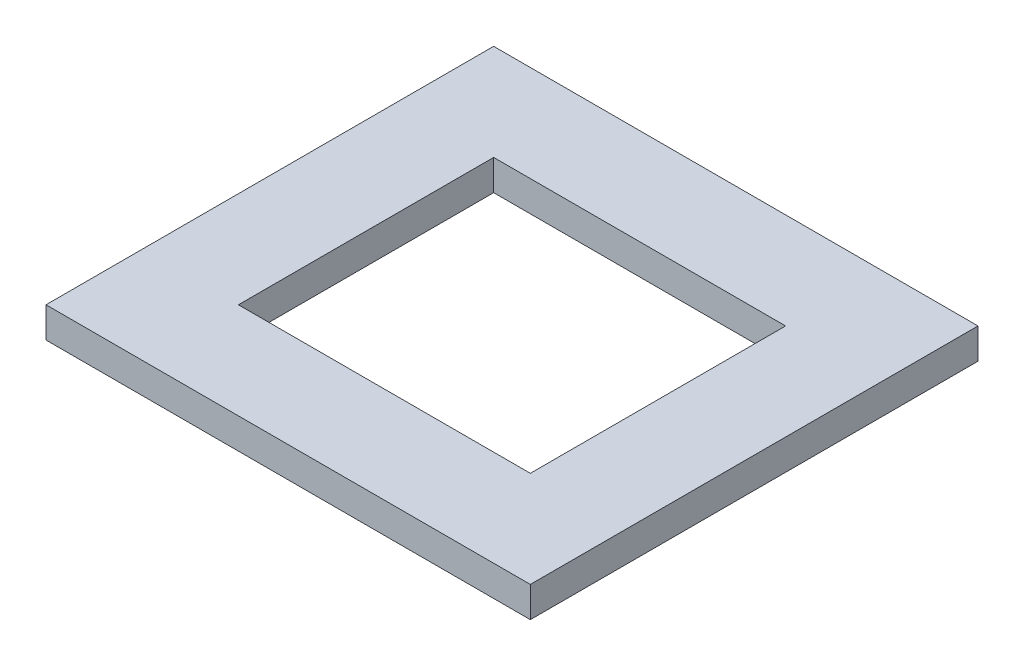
ISO-10303-21;
HEADER;
FILE_DESCRIPTION(('STEP AP214'),'2;1');
FILE_NAME('part.step','',(''),(''),'','','');
FILE_SCHEMA(('AUTOMOTIVE_DESIGN { 1 0 10303 214 1 1 1 1 }'));
ENDSEC;
DATA;
#1=APPLICATION_CONTEXT('core data for automotive mechanical design processes');
#2=APPLICATION_PROTOCOL_DEFINITION('international standard','automotive_design',2000,#1);
#3=PRODUCT_CONTEXT('',#1,'mechanical');
#4=PRODUCT('Part','Part','',(#3));
#5=PRODUCT_RELATED_PRODUCT_CATEGORY('part','',(#4));
#6=PRODUCT_DEFINITION_FORMATION('','',#4);
#7=PRODUCT_DEFINITION_CONTEXT('part definition',#1,'design');
#8=PRODUCT_DEFINITION('design','',#6,#7);
#9=PRODUCT_DEFINITION_SHAPE('','',#8);
#10=(LENGTH_UNIT() NAMED_UNIT(*) SI_UNIT(.MILLI.,.METRE.));
#11=(NAMED_UNIT(*) PLANE_ANGLE_UNIT() SI_UNIT($,.RADIAN.));
#12=(NAMED_UNIT(*) SI_UNIT($,.STERADIAN.) SOLID_ANGLE_UNIT());
#13=UNCERTAINTY_MEASURE_WITH_UNIT(LENGTH_MEASURE(1.E-05),#10,'distance_accuracy_value','');
#14=(GEOMETRIC_REPRESENTATION_CONTEXT(3) GLOBAL_UNCERTAINTY_ASSIGNED_CONTEXT((#13)) GLOBAL_UNIT_ASSIGNED_CONTEXT((#10,
#11,#12)) REPRESENTATION_CONTEXT('',''));
#15=CARTESIAN_POINT('',(0.,0.,0.));
#16=DIRECTION('',(0.,0.,1.));
#17=DIRECTION('',(1.,0.,0.));
#18=AXIS2_PLACEMENT_3D('',#15,#16,#17);
#19=CARTESIAN_POINT('',(0.,7.145,0.));
#20=DIRECTION('',(0.,1.,0.));
#21=DIRECTION('',(0.,0.,1.));
#22=AXIS2_PLACEMENT_3D('',#19,#20,#21);
#23=PLANE('',#22);
#24=DIRECTION('',(0.,0.,-1.));
#25=VECTOR('',#24,1.);
#26=CARTESIAN_POINT('',(113.265,7.145,-104.69));
#27=LINE('',#26,#25);
#28=CARTESIAN_POINT('',(113.265,7.145,104.69));
#29=VERTEX_POINT('',#28);
#30=CARTESIAN_POINT('',(113.265,7.145,-104.69));
#31=VERTEX_POINT('',#30);
#32=EDGE_CURVE('E135',#29,#31,#27,.T.);
#33=ORIENTED_EDGE('',*,*,#32,.T.);
#34=DIRECTION('',(-1.,0.,0.));
#35=VECTOR('',#34,1.);
#36=CARTESIAN_POINT('',(-113.265,7.145,-104.69));
#37=LINE('',#36,#35);
#38=CARTESIAN_POINT('',(-113.265,7.145,-104.69));
#39=VERTEX_POINT('',#38);
#40=EDGE_CURVE('E138',#31,#39,#37,.T.);
#41=ORIENTED_EDGE('',*,*,#40,.T.);
#42=DIRECTION('',(0.,0.,1.));
#43=VECTOR('',#42,1.);
#44=CARTESIAN_POINT('',(-113.265,7.145,-104.69));
#45=LINE('',#44,#43);
#46=CARTESIAN_POINT('',(-113.265,7.145,104.69));
#47=VERTEX_POINT('',#46);
#48=EDGE_CURVE('E141',#39,#47,#45,.T.);
#49=ORIENTED_EDGE('',*,*,#48,.T.);
#50=DIRECTION('',(1.,0.,0.));
#51=VECTOR('',#50,1.);
#52=CARTESIAN_POINT('',(-113.265,7.145,104.69));
#53=LINE('',#52,#51);
#54=EDGE_CURVE('E143',#47,#29,#53,.T.);
#55=ORIENTED_EDGE('',*,*,#54,.T.);
#56=EDGE_LOOP('',(#33,#41,#49,#55));
#57=FACE_BOUND('',#56,.T.);
#58=DIRECTION('',(-1.,0.,0.));
#59=VECTOR('',#58,1.);
#60=CARTESIAN_POINT('',(-68.2650000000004,7.145,-59.6900000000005));
#61=LINE('',#60,#59);
#62=CARTESIAN_POINT('',(68.2649999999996,7.145,-59.6900000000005));
#63=VERTEX_POINT('',#62);
#64=CARTESIAN_POINT('',(-68.2650000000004,7.145,-59.6900000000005));
#65=VERTEX_POINT('',#64);
#66=EDGE_CURVE('E107',#63,#65,#61,.T.);
#67=ORIENTED_EDGE('',*,*,#66,.F.);
#68=DIRECTION('',(0.,0.,-1.));
#69=VECTOR('',#68,1.);
#70=CARTESIAN_POINT('',(68.2649999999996,7.145,-59.6900000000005));
#71=LINE('',#70,#69);
#72=CARTESIAN_POINT('',(68.2649999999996,7.145,59.6899999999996));
#73=VERTEX_POINT('',#72);
#74=EDGE_CURVE('E99',#73,#63,#71,.T.);
#75=ORIENTED_EDGE('',*,*,#74,.F.);
#76=DIRECTION('',(1.,0.,0.));
#77=VECTOR('',#76,1.);
#78=CARTESIAN_POINT('',(-68.2650000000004,7.145,59.6899999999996));
#79=LINE('',#78,#77);
#80=CARTESIAN_POINT('',(-68.2650000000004,7.145,59.6899999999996));
#81=VERTEX_POINT('',#80);
#82=EDGE_CURVE('E121',#81,#73,#79,.T.);
#83=ORIENTED_EDGE('',*,*,#82,.F.);
#84=DIRECTION('',(0.,0.,1.));
#85=VECTOR('',#84,1.);
#86=CARTESIAN_POINT('',(-68.2650000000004,7.145,-59.6900000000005));
#87=LINE('',#86,#85);
#88=EDGE_CURVE('E119',#65,#81,#87,.T.);
#89=ORIENTED_EDGE('',*,*,#88,.F.);
#90=EDGE_LOOP('',(#67,#75,#83,#89));
#91=FACE_BOUND('',#90,.T.);
#92=ADVANCED_FACE('F34',(#57,#91),#23,.T.);
#93=CARTESIAN_POINT('',(0.,-7.145,0.));
#94=DIRECTION('',(0.,1.,0.));
#95=DIRECTION('',(0.,0.,1.));
#96=AXIS2_PLACEMENT_3D('',#93,#94,#95);
#97=PLANE('',#96);
#98=DIRECTION('',(0.,0.,-1.));
#99=VECTOR('',#98,1.);
#100=CARTESIAN_POINT('',(113.265,-7.145,-104.69));
#101=LINE('',#100,#99);
#102=CARTESIAN_POINT('',(113.265,-7.145,104.69));
#103=VERTEX_POINT('',#102);
#104=CARTESIAN_POINT('',(113.265,-7.145,-104.69));
#105=VERTEX_POINT('',#104);
#106=EDGE_CURVE('E115',#103,#105,#101,.T.);
#107=ORIENTED_EDGE('',*,*,#106,.F.);
#108=DIRECTION('',(1.,0.,0.));
#109=VECTOR('',#108,1.);
#110=CARTESIAN_POINT('',(-113.265,-7.145,104.69));
#111=LINE('',#110,#109);
#112=CARTESIAN_POINT('',(-113.265,-7.145,104.69));
#113=VERTEX_POINT('',#112);
#114=EDGE_CURVE('E139',#113,#103,#111,.T.);
#115=ORIENTED_EDGE('',*,*,#114,.F.);
#116=DIRECTION('',(0.,0.,1.));
#117=VECTOR('',#116,1.);
#118=CARTESIAN_POINT('',(-113.265,-7.145,-104.69));
#119=LINE('',#118,#117);
#120=CARTESIAN_POINT('',(-113.265,-7.145,-104.69));
#121=VERTEX_POINT('',#120);
#122=EDGE_CURVE('E150',#121,#113,#119,.T.);
#123=ORIENTED_EDGE('',*,*,#122,.F.);
#124=DIRECTION('',(-1.,0.,0.));
#125=VECTOR('',#124,1.);
#126=CARTESIAN_POINT('',(-113.265,-7.145,-104.69));
#127=LINE('',#126,#125);
#128=EDGE_CURVE('E148',#105,#121,#127,.T.);
#129=ORIENTED_EDGE('',*,*,#128,.F.);
#130=EDGE_LOOP('',(#107,#115,#123,#129));
#131=FACE_BOUND('',#130,.T.);
#132=DIRECTION('',(0.,0.,-1.));
#133=VECTOR('',#132,1.);
#134=CARTESIAN_POINT('',(68.2649999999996,-7.145,-59.6900000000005));
#135=LINE('',#134,#133);
#136=CARTESIAN_POINT('',(68.2649999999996,-7.145,59.6899999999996));
#137=VERTEX_POINT('',#136);
#138=CARTESIAN_POINT('',(68.2649999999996,-7.145,-59.6900000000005));
#139=VERTEX_POINT('',#138);
#140=EDGE_CURVE('E57',#137,#139,#135,.T.);
#141=ORIENTED_EDGE('',*,*,#140,.T.);
#142=DIRECTION('',(-1.,0.,0.));
#143=VECTOR('',#142,1.);
#144=CARTESIAN_POINT('',(-68.2650000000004,-7.145,-59.6900000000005));
#145=LINE('',#144,#143);
#146=CARTESIAN_POINT('',(-68.2650000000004,-7.145,-59.6900000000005));
#147=VERTEX_POINT('',#146);
#148=EDGE_CURVE('E114',#139,#147,#145,.T.);
#149=ORIENTED_EDGE('',*,*,#148,.T.);
#150=DIRECTION('',(0.,0.,1.));
#151=VECTOR('',#150,1.);
#152=CARTESIAN_POINT('',(-68.2650000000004,-7.145,-59.6900000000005));
#153=LINE('',#152,#151);
#154=CARTESIAN_POINT('',(-68.2650000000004,-7.145,59.6899999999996));
#155=VERTEX_POINT('',#154);
#156=EDGE_CURVE('E127',#147,#155,#153,.T.);
#157=ORIENTED_EDGE('',*,*,#156,.T.);
#158=DIRECTION('',(1.,0.,0.));
#159=VECTOR('',#158,1.);
#160=CARTESIAN_POINT('',(-68.2650000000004,-7.145,59.6899999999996));
#161=LINE('',#160,#159);
#162=EDGE_CURVE('E108',#155,#137,#161,.T.);
#163=ORIENTED_EDGE('',*,*,#162,.T.);
#164=EDGE_LOOP('',(#141,#149,#157,#163));
#165=FACE_BOUND('',#164,.T.);
#166=ADVANCED_FACE('F168',(#131,#165),#97,.F.);
#167=CARTESIAN_POINT('',(113.265,7.145,-104.69));
#168=DIRECTION('',(-1.,0.,0.));
#169=DIRECTION('',(0.,0.,1.));
#170=AXIS2_PLACEMENT_3D('',#167,#168,#169);
#171=PLANE('',#170);
#172=ORIENTED_EDGE('',*,*,#106,.T.);
#173=DIRECTION('',(0.,-1.,0.));
#174=VECTOR('',#173,1.);
#175=CARTESIAN_POINT('',(113.265,7.145,-104.69));
#176=LINE('',#175,#174);
#177=EDGE_CURVE('E11',#31,#105,#176,.T.);
#178=ORIENTED_EDGE('',*,*,#177,.F.);
#179=ORIENTED_EDGE('',*,*,#32,.F.);
#180=DIRECTION('',(0.,-1.,0.));
#181=VECTOR('',#180,1.);
#182=CARTESIAN_POINT('',(113.265,7.145,104.69));
#183=LINE('',#182,#181);
#184=EDGE_CURVE('E145',#29,#103,#183,.T.);
#185=ORIENTED_EDGE('',*,*,#184,.T.);
#186=EDGE_LOOP('',(#172,#178,#179,#185));
#187=FACE_BOUND('',#186,.T.);
#188=ADVANCED_FACE('F36',(#187),#171,.F.);
#189=CARTESIAN_POINT('',(-113.265,7.145,-104.69));
#190=DIRECTION('',(0.,0.,1.));
#191=DIRECTION('',(1.,0.,0.));
#192=AXIS2_PLACEMENT_3D('',#189,#190,#191);
#193=PLANE('',#192);
#194=ORIENTED_EDGE('',*,*,#128,.T.);
#195=DIRECTION('',(0.,-1.,0.));
#196=VECTOR('',#195,1.);
#197=CARTESIAN_POINT('',(-113.265,7.145,-104.69));
#198=LINE('',#197,#196);
#199=EDGE_CURVE('E42',#39,#121,#198,.T.);
#200=ORIENTED_EDGE('',*,*,#199,.F.);
#201=ORIENTED_EDGE('',*,*,#40,.F.);
#202=ORIENTED_EDGE('',*,*,#177,.T.);
#203=EDGE_LOOP('',(#194,#200,#201,#202));
#204=FACE_BOUND('',#203,.T.);
#205=ADVANCED_FACE('F178',(#204),#193,.F.);
#206=CARTESIAN_POINT('',(-113.265,7.145,-104.69));
#207=DIRECTION('',(1.,0.,0.));
#208=DIRECTION('',(0.,0.,-1.));
#209=AXIS2_PLACEMENT_3D('',#206,#207,#208);
#210=PLANE('',#209);
#211=ORIENTED_EDGE('',*,*,#122,.T.);
#212=DIRECTION('',(0.,-1.,0.));
#213=VECTOR('',#212,1.);
#214=CARTESIAN_POINT('',(-113.265,7.145,104.69));
#215=LINE('',#214,#213);
#216=EDGE_CURVE('E155',#47,#113,#215,.T.);
#217=ORIENTED_EDGE('',*,*,#216,.F.);
#218=ORIENTED_EDGE('',*,*,#48,.F.);
#219=ORIENTED_EDGE('',*,*,#199,.T.);
#220=EDGE_LOOP('',(#211,#217,#218,#219));
#221=FACE_BOUND('',#220,.T.);
#222=ADVANCED_FACE('F162',(#221),#210,.F.);
#223=CARTESIAN_POINT('',(-113.265,7.145,104.69));
#224=DIRECTION('',(0.,0.,-1.));
#225=DIRECTION('',(-1.,0.,0.));
#226=AXIS2_PLACEMENT_3D('',#223,#224,#225);
#227=PLANE('',#226);
#228=ORIENTED_EDGE('',*,*,#114,.T.);
#229=ORIENTED_EDGE('',*,*,#184,.F.);
#230=ORIENTED_EDGE('',*,*,#54,.F.);
#231=ORIENTED_EDGE('',*,*,#216,.T.);
#232=EDGE_LOOP('',(#228,#229,#230,#231));
#233=FACE_BOUND('',#232,.T.);
#234=ADVANCED_FACE('F172',(#233),#227,.F.);
#235=CARTESIAN_POINT('',(68.2649999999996,7.145,-59.6900000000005));
#236=DIRECTION('',(-1.,0.,0.));
#237=DIRECTION('',(0.,0.,1.));
#238=AXIS2_PLACEMENT_3D('',#235,#236,#237);
#239=PLANE('',#238);
#240=ORIENTED_EDGE('',*,*,#140,.F.);
#241=DIRECTION('',(0.,-1.,0.));
#242=VECTOR('',#241,1.);
#243=CARTESIAN_POINT('',(68.2649999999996,7.145,59.6899999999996));
#244=LINE('',#243,#242);
#245=EDGE_CURVE('E103',#73,#137,#244,.T.);
#246=ORIENTED_EDGE('',*,*,#245,.F.);
#247=ORIENTED_EDGE('',*,*,#74,.T.);
#248=DIRECTION('',(0.,-1.,0.));
#249=VECTOR('',#248,1.);
#250=CARTESIAN_POINT('',(68.2649999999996,7.145,-59.6900000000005));
#251=LINE('',#250,#249);
#252=EDGE_CURVE('E102',#63,#139,#251,.T.);
#253=ORIENTED_EDGE('',*,*,#252,.T.);
#254=EDGE_LOOP('',(#240,#246,#247,#253));
#255=FACE_BOUND('',#254,.T.);
#256=ADVANCED_FACE('F101',(#255),#239,.T.);
#257=CARTESIAN_POINT('',(-68.2650000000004,7.145,-59.6900000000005));
#258=DIRECTION('',(0.,0.,1.));
#259=DIRECTION('',(1.,0.,0.));
#260=AXIS2_PLACEMENT_3D('',#257,#258,#259);
#261=PLANE('',#260);
#262=ORIENTED_EDGE('',*,*,#148,.F.);
#263=ORIENTED_EDGE('',*,*,#252,.F.);
#264=ORIENTED_EDGE('',*,*,#66,.T.);
#265=DIRECTION('',(0.,-1.,0.));
#266=VECTOR('',#265,1.);
#267=CARTESIAN_POINT('',(-68.2650000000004,7.145,-59.6900000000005));
#268=LINE('',#267,#266);
#269=EDGE_CURVE('E116',#65,#147,#268,.T.);
#270=ORIENTED_EDGE('',*,*,#269,.T.);
#271=EDGE_LOOP('',(#262,#263,#264,#270));
#272=FACE_BOUND('',#271,.T.);
#273=ADVANCED_FACE('F111',(#272),#261,.T.);
#274=CARTESIAN_POINT('',(-68.2650000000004,7.145,-59.6900000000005));
#275=DIRECTION('',(1.,0.,0.));
#276=DIRECTION('',(0.,0.,-1.));
#277=AXIS2_PLACEMENT_3D('',#274,#275,#276);
#278=PLANE('',#277);
#279=ORIENTED_EDGE('',*,*,#156,.F.);
#280=ORIENTED_EDGE('',*,*,#269,.F.);
#281=ORIENTED_EDGE('',*,*,#88,.T.);
#282=DIRECTION('',(0.,-1.,0.));
#283=VECTOR('',#282,1.);
#284=CARTESIAN_POINT('',(-68.2650000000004,7.145,59.6899999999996));
#285=LINE('',#284,#283);
#286=EDGE_CURVE('E49',#81,#155,#285,.T.);
#287=ORIENTED_EDGE('',*,*,#286,.T.);
#288=EDGE_LOOP('',(#279,#280,#281,#287));
#289=FACE_BOUND('',#288,.T.);
#290=ADVANCED_FACE('F201',(#289),#278,.T.);
#291=CARTESIAN_POINT('',(-68.2650000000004,7.145,59.6899999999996));
#292=DIRECTION('',(0.,0.,-1.));
#293=DIRECTION('',(-1.,0.,0.));
#294=AXIS2_PLACEMENT_3D('',#291,#292,#293);
#295=PLANE('',#294);
#296=ORIENTED_EDGE('',*,*,#162,.F.);
#297=ORIENTED_EDGE('',*,*,#286,.F.);
#298=ORIENTED_EDGE('',*,*,#82,.T.);
#299=ORIENTED_EDGE('',*,*,#245,.T.);
#300=EDGE_LOOP('',(#296,#297,#298,#299));
#301=FACE_BOUND('',#300,.T.);
#302=ADVANCED_FACE('F205',(#301),#295,.T.);
#303=CLOSED_SHELL('',(#92,#166,#188,#205,#222,#234,#256,#273,#290,#302));
#304=MANIFOLD_SOLID_BREP('B2',#303);
#305=ADVANCED_BREP_SHAPE_REPRESENTATION('',(#18,#304),#14);
#306=SHAPE_DEFINITION_REPRESENTATION(#9,#305);
ENDSEC;
END-ISO-10303-21;
